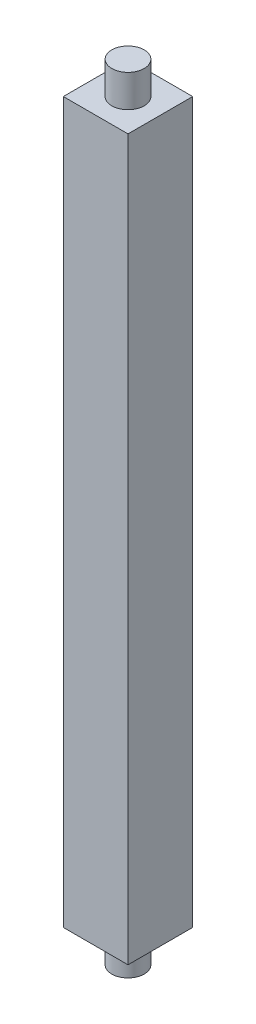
from build123d import *

# Parameters (mm, degrees)
SKETCH1_W           = 4
SKETCH1_H           = 4
BOSS_EXTRUDE1_DEPTH = 44.5
SKETCH2_R           = 1
BOSS_EXTRUDE2_DEPTH = 2
BOSS_EXTRUDE3_START = 2
SKETCH3_R           = 1
BOSS_EXTRUDE3_DEPTH = 2


with BuildPart() as part:
    # Sketch1 → Boss-Extrude1 (new body)
    with BuildSketch(Plane(origin=(0, 0, 0), x_dir=(1, 0, 0), z_dir=(0, 1, 0))):
        Rectangle(SKETCH1_W, SKETCH1_H)
    extrude(amount=BOSS_EXTRUDE1_DEPTH)

    # Sketch2 → Boss-Extrude2 (add)
    with BuildSketch(Plane(origin=(0, 44.5, 0), x_dir=(1, 0, 0), z_dir=(0, 1, 0))):
        with Locations(Location((0, 0, 0), (0, 0, 90))):
            Circle(SKETCH2_R)
    extrude(amount=BOSS_EXTRUDE2_DEPTH)

    # Sketch3 → Boss-Extrude3 (add)
    with BuildSketch(Plane.XZ.offset(BOSS_EXTRUDE3_START)):
        with Locations(Location((0, 0, 0), (0, 0, 270))):
            Circle(SKETCH3_R)
    extrude(amount=-BOSS_EXTRUDE3_DEPTH)


solid = part.part
